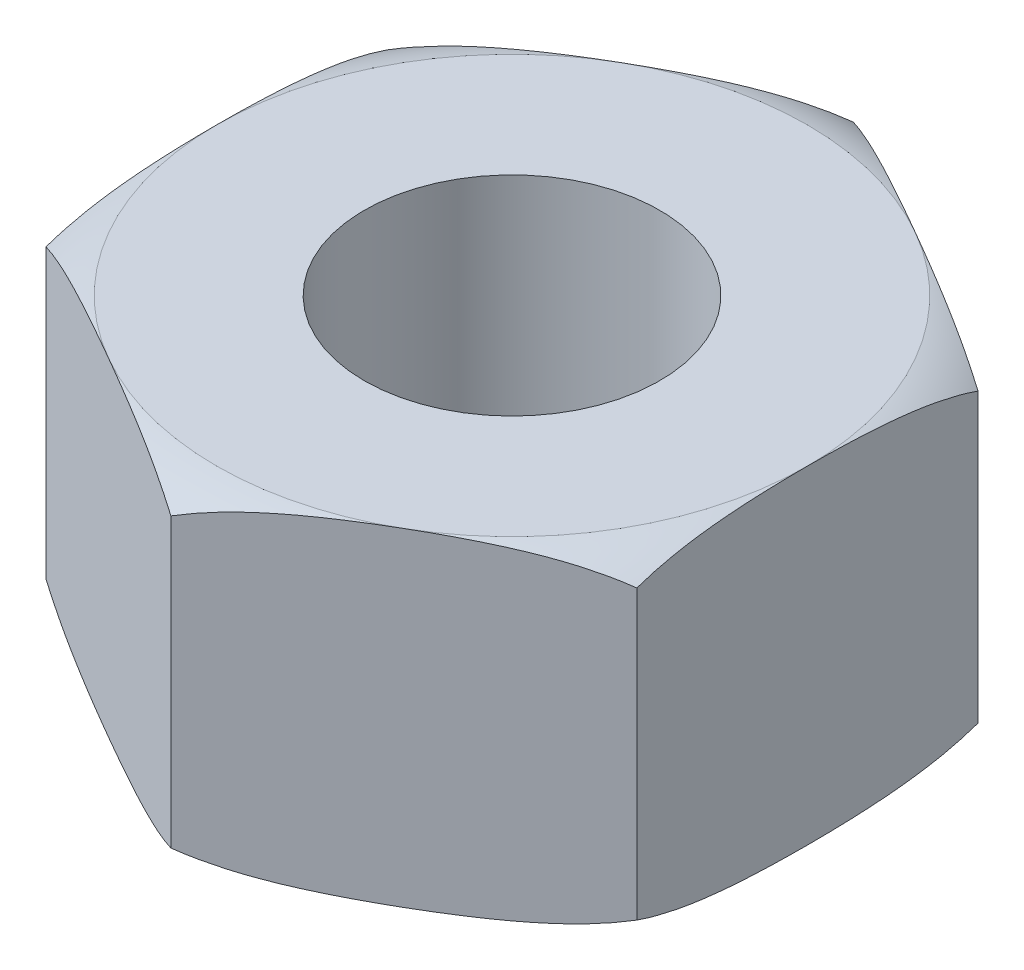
from build123d import *

# Parameters (mm, degrees)
SKETCH1_R           = 4.5
BOSS_EXTRUDE1_DEPTH = 5


with BuildPart() as part:
    # Sketch1 → Boss-Extrude1 (new, symmetric)
    with BuildSketch(Plane(origin=(0, 0, 0), x_dir=(1, 0, 0), z_dir=(0, 1, 0))):
        Polygon((0, 10.392304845), (-9, 5.196152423), (-9, -5.196152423), (0, -10.392304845), (9, -5.196152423), (9, 5.196152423), align=None)
        with Locations(Location((0, 0, 0), (0, 0, 270))):
            Circle(SKETCH1_R, mode=Mode.SUBTRACT)
    extrude(amount=BOSS_EXTRUDE1_DEPTH, both=True)

    # Sketch4 → Cut-Revolve1 (revolve, cut)
    with BuildSketch(Plane.XY):
        with BuildLine():
            Line((9, 5), (12, 5))
            Line((12, 5), (12, 2))
            ThreePointArc((12, 2), (10.930511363, 3.930511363), (9, 5))
        make_face()
    cut_revolve1 = revolve(axis=Axis((0, 0, 0), (0, 1, 0)), mode=Mode.SUBTRACT)

    # Mirror1: Cut-Revolve1 across plane
    add(cut_revolve1.mirror(Plane.ZX), mode=Mode.SUBTRACT)


solid = part.part
